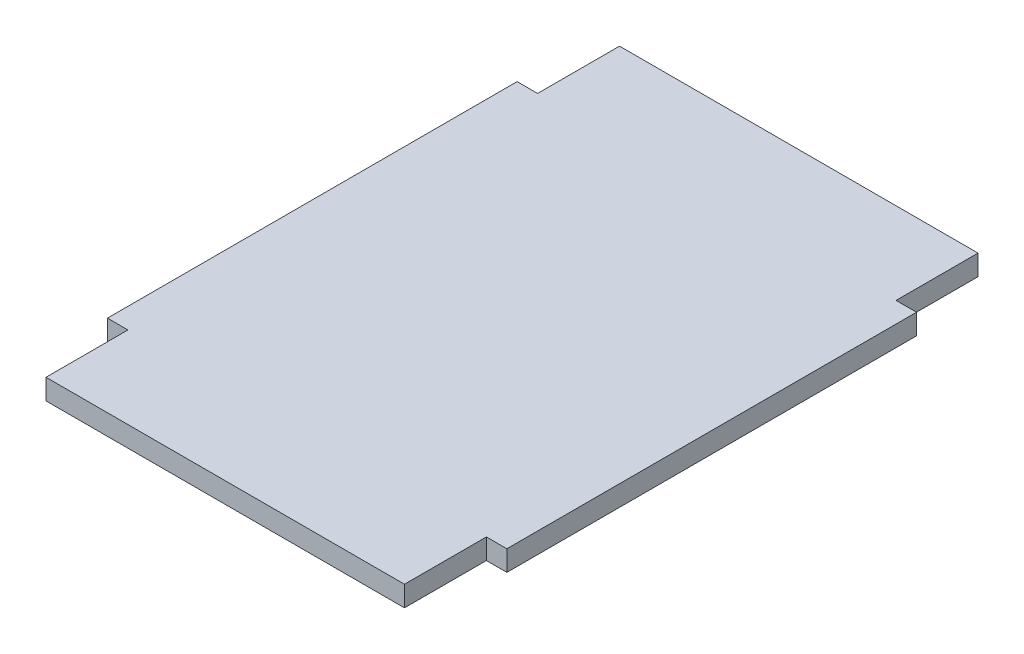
from build123d import *

# Parameters (mm, degrees)
SKETCH_1_W      = 2
SKETCH_1_H      = 40
SKETCH_1_W_2    = 35
SKETCH_1_H_2    = 56
EXTRUDE_1_DEPTH = 2


with BuildPart() as part:
    # Sketch 1 → Extrude 1 (new body)
    with BuildSketch(Plane(origin=(0, 0, 0), x_dir=(1, 0, 0), z_dir=(0, 1, 0))):
        with Locations((-1, 28)):
            Rectangle(SKETCH_1_W, SKETCH_1_H)
        with Locations((17.5, 28)):
            Rectangle(SKETCH_1_W_2, SKETCH_1_H_2)
        with Locations((36, 28)):
            Rectangle(SKETCH_1_W, SKETCH_1_H)
    extrude(amount=EXTRUDE_1_DEPTH)


solid = part.part
